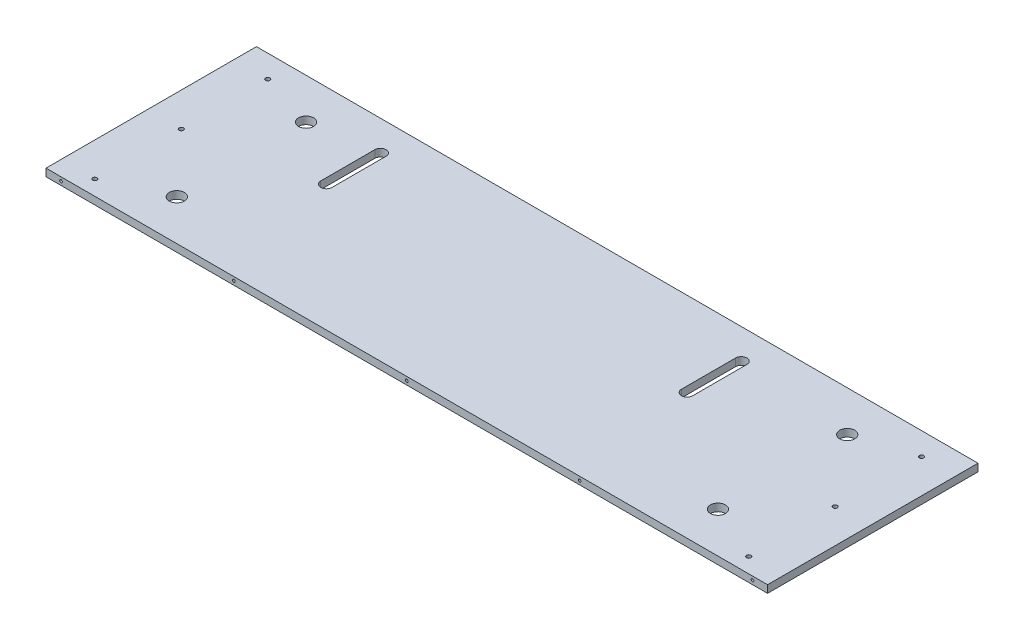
from build123d import *

# Parameters (mm, degrees)
SKETCH1_W                                      = 609.6
SKETCH1_H                                      = 177.8
BOSS_EXTRUDE1_DEPTH                            = 6.35
F_4_40_TAPPED_HOLE1_D                          = 2.2606
F_4_40_TAPPED_HOLE1_DEPTH                      = 7.5946
F_4_40_TAPPED_HOLE1_TIP                        = 0.679152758
CSK_FOR_6_FLAT_HEAD_MACHINE_SCREW1_D           = 3.6576
CSK_FOR_6_FLAT_HEAD_MACHINE_SCREW1_CSINK_D     = 7.0866
CSK_FOR_6_FLAT_HEAD_MACHINE_SCREW1_CSINK_ANGLE = 82
F_1_2_0_5_DIAMETER_HOLE1_D                     = 12.7
CUT_EXTRUDE1_DEPTH                             = 318.563493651


with BuildPart() as part:
    # Sketch1 → Boss-Extrude1 (new body)
    with BuildSketch(Plane(origin=(0, 0, 0), x_dir=(1, 0, 0), z_dir=(0, 1, 0))):
        Rectangle(SKETCH1_W, SKETCH1_H)
    extrude(amount=BOSS_EXTRUDE1_DEPTH)

    # 4-40 Tapped Hole1
    with Locations(Plane.XY.offset(88.9)):
        with Locations((-292.1, 3.175), (-146.05, 3.175), (0, 3.175), (146.05, 3.175), (292.1, 3.175)):
            Hole(F_4_40_TAPPED_HOLE1_D / 2, depth=F_4_40_TAPPED_HOLE1_DEPTH)
            with Locations((0, 0, -(F_4_40_TAPPED_HOLE1_DEPTH + F_4_40_TAPPED_HOLE1_TIP / 2))):  # 118° drill point
                Cone(0, F_4_40_TAPPED_HOLE1_D / 2, F_4_40_TAPPED_HOLE1_TIP, mode=Mode.SUBTRACT)

    # CSK for _6 Flat Head Machine Screw1 (through all)
    with Locations(Plane(origin=(0, 0, 0), x_dir=(-1, 0, 0), z_dir=(0, -1, 0))):
        with Locations((276.225, -76.2), (276.225, -3.175), (276.225, 69.85), (-276.225, 69.85), (-276.225, -3.175), (-276.225, -76.2)):
            CounterSinkHole(CSK_FOR_6_FLAT_HEAD_MACHINE_SCREW1_D / 2, CSK_FOR_6_FLAT_HEAD_MACHINE_SCREW1_CSINK_D / 2, counter_sink_angle=CSK_FOR_6_FLAT_HEAD_MACHINE_SCREW1_CSINK_ANGLE)

    # 1_2 _0.5_ Diameter Hole1 (through all)
    with Locations(Plane(origin=(0, 0, 0), x_dir=(-1, 0, 0), z_dir=(0, -1, 0))):
        with Locations((228.6, -54.61), (228.6, 54.61), (-228.6, 54.61), (-228.6, -54.61)):
            Hole(F_1_2_0_5_DIAMETER_HOLE1_D / 2)

    # Sketch8 → Cut-Extrude1 (cut, through all)
    with BuildSketch(Plane.XZ):
        with BuildLine():
            Line((-179.3875, -17.78), (-179.3875, -63.5))
            ThreePointArc((-179.3875, -63.5), (-174.625, -68.2625), (-169.8625, -63.5))
            Line((-169.8625, -63.5), (-169.8625, -17.78))
            ThreePointArc((-169.8625, -17.78), (-174.625, -13.0175), (-179.3875, -17.78))
        make_face()
        with BuildLine():
            Line((125.4125, -17.78), (125.4125, -63.5))
            ThreePointArc((125.4125, -63.5), (130.175, -68.2625), (134.9375, -63.5))
            Line((134.9375, -63.5), (134.9375, -17.78))
            ThreePointArc((134.9375, -17.78), (130.175, -13.0175), (125.4125, -17.78))
        make_face()
    extrude(amount=-CUT_EXTRUDE1_DEPTH, mode=Mode.SUBTRACT)


solid = part.part
